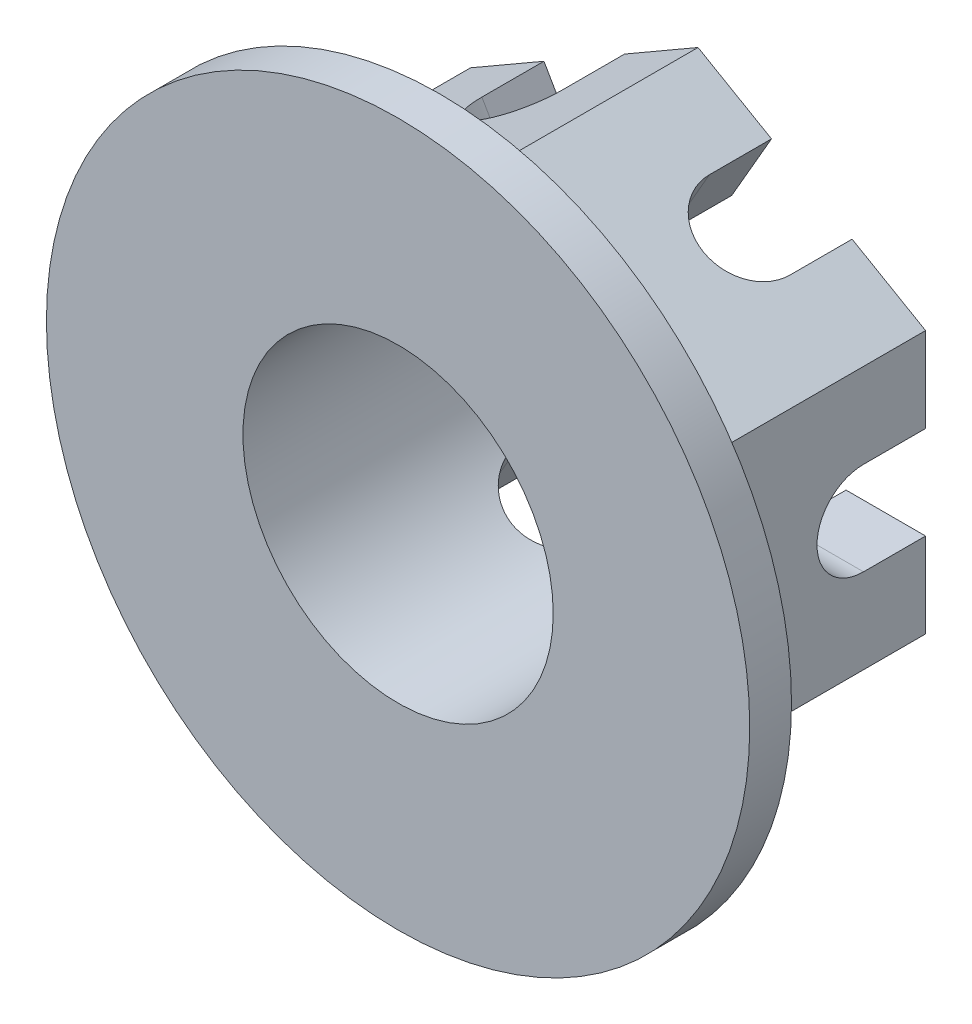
from build123d import *

# Parameters (mm, degrees)
BASE_EXTRUSION_DEPTH         = 10
ESQUISSE2_R                  = 12.701705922
BOSS_EXTRU_1_DEPTH           = 4.5
BOSS_EXTRU_1_DRAFT           = -60
ESQUISSE3_W                  = 10
ESQUISSE3_H                  = 10
ENL_V_MAT_EXTRU_2_DEPTH      = 50
R_P_TITION_CIRCULAIRE1_COUNT = 3
ESQUISSE5_R                  = 7.5
ENL_V_MAT_EXTRU_3_DEPTH      = 29.075790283


with BuildPart() as part:
    # Esquisse1 → Base-Extrusion (new body)
    with BuildSketch(Plane.XY):
        Polygon((0, -12.701705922), (-11, -6.350852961), (-11, 6.350852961), (0, 12.701705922), (11, 6.350852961), (11, -6.350852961), align=None)
    extrude(amount=BASE_EXTRUSION_DEPTH)


with BuildPart() as boss_extru_1_tool:
    # Esquisse2 → Boss.-Extru.1 (with draft: the straight prism first)
    with BuildSketch(Plane.XY.offset(10)):
        Circle(ESQUISSE2_R)
    extrude(amount=BOSS_EXTRU_1_DEPTH)
    # Boss.-Extru.1: the draft: its side faces are tilted about the plane it starts from
    boss_extru_1_sides = [boss_extru_1_tool.faces().sort_by_distance(p)[0] for p in [
        (-12.701705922, 0, 12.25),
    ]]
    draft(boss_extru_1_sides, Plane.XY.offset(10), BOSS_EXTRU_1_DRAFT)


with BuildPart() as part_1:
    add(part.part)

    # Boss.-Extru.1: add boss_extru_1_tool
    add(boss_extru_1_tool.part)

    # Esquisse3 → Enl_vement de mati_re-R_volution1 (revolve, cut)
    with BuildSketch(Plane(origin=(0, 0, 0), x_dir=(0, 0, -1), z_dir=(1, 0, 0)), mode=Mode.PRIVATE) as enl_vement_de_mati_re_r_volution1_sk:
        with Locations((-15, 22)):
            Rectangle(ESQUISSE3_W, ESQUISSE3_H)
    revolve(enl_vement_de_mati_re_r_volution1_sk.sketch.rotate(Axis((0, 0, 43.863612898), (0, 0, -1)), 90), axis=Axis((0, 0, 43.863612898), (0, 0, -1)), mode=Mode.SUBTRACT)

    # Esquisse4 → Enl_v. mat.-Extru.2 (cut, symmetric)
    with BuildSketch(Plane(origin=(0, 0, 0), x_dir=(0, 0, -1), z_dir=(1, 0, 0))):
        with BuildLine():
            Line((-3, 2.25), (0, 2.25))
            Line((0, 2.25), (0, -2.25))
            Line((0, -2.25), (-3, -2.25))
            ThreePointArc((-3, -2.25), (-5.25, 0), (-3, 2.25))
        make_face()
    enl_v_mat_extru_2 = extrude(amount=ENL_V_MAT_EXTRU_2_DEPTH, both=True, mode=Mode.SUBTRACT)

    # R_p_tition circulaire1: Enl_v. mat.-Extru.2 ×3 about axis
    r_p_tition_circulaire1_axis = Axis((0, 0, -6.136387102), (0, 0, 1))
    for i in range(1, R_P_TITION_CIRCULAIRE1_COUNT):
        add(enl_v_mat_extru_2.rotate(r_p_tition_circulaire1_axis, i * 360 / R_P_TITION_CIRCULAIRE1_COUNT), mode=Mode.SUBTRACT)

    # Esquisse5 → Enl_v. mat.-Extru.3 (cut, through all)
    with BuildSketch(Plane.XY.offset(14.5)):
        Circle(ESQUISSE5_R)
    extrude(amount=-ENL_V_MAT_EXTRU_3_DEPTH, mode=Mode.SUBTRACT)


solid = part_1.part
